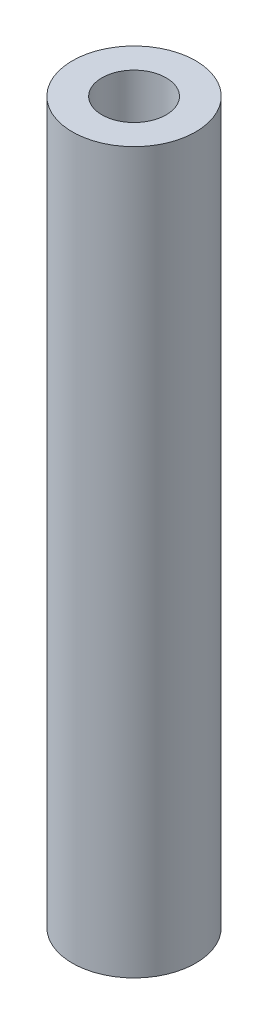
ISO-10303-21;
HEADER;
FILE_DESCRIPTION(('STEP AP214'),'2;1');
FILE_NAME('part.step','',(''),(''),'','','');
FILE_SCHEMA(('AUTOMOTIVE_DESIGN { 1 0 10303 214 1 1 1 1 }'));
ENDSEC;
DATA;
#1=APPLICATION_CONTEXT('core data for automotive mechanical design processes');
#2=APPLICATION_PROTOCOL_DEFINITION('international standard','automotive_design',2000,#1);
#3=PRODUCT_CONTEXT('',#1,'mechanical');
#4=PRODUCT('Part','Part','',(#3));
#5=PRODUCT_RELATED_PRODUCT_CATEGORY('part','',(#4));
#6=PRODUCT_DEFINITION_FORMATION('','',#4);
#7=PRODUCT_DEFINITION_CONTEXT('part definition',#1,'design');
#8=PRODUCT_DEFINITION('design','',#6,#7);
#9=PRODUCT_DEFINITION_SHAPE('','',#8);
#10=(LENGTH_UNIT() NAMED_UNIT(*) SI_UNIT(.MILLI.,.METRE.));
#11=(NAMED_UNIT(*) PLANE_ANGLE_UNIT() SI_UNIT($,.RADIAN.));
#12=(NAMED_UNIT(*) SI_UNIT($,.STERADIAN.) SOLID_ANGLE_UNIT());
#13=UNCERTAINTY_MEASURE_WITH_UNIT(LENGTH_MEASURE(1.E-05),#10,'distance_accuracy_value','');
#14=(GEOMETRIC_REPRESENTATION_CONTEXT(3) GLOBAL_UNCERTAINTY_ASSIGNED_CONTEXT((#13)) GLOBAL_UNIT_ASSIGNED_CONTEXT((#10,
#11,#12)) REPRESENTATION_CONTEXT('',''));
#15=CARTESIAN_POINT('',(0.,0.,0.));
#16=DIRECTION('',(0.,0.,1.));
#17=DIRECTION('',(1.,0.,0.));
#18=AXIS2_PLACEMENT_3D('',#15,#16,#17);
#19=CARTESIAN_POINT('',(0.,55.59,0.));
#20=DIRECTION('',(0.,1.,0.));
#21=DIRECTION('',(0.,0.,1.));
#22=AXIS2_PLACEMENT_3D('',#19,#20,#21);
#23=PLANE('',#22);
#24=CARTESIAN_POINT('',(0.,55.59,0.));
#25=DIRECTION('',(0.,1.,0.));
#26=DIRECTION('',(0.,0.,1.));
#27=AXIS2_PLACEMENT_3D('',#24,#25,#26);
#28=CIRCLE('',#27,4.7625);
#29=CARTESIAN_POINT('',(0.,55.59,-4.7625));
#30=VERTEX_POINT('',#29);
#31=EDGE_CURVE('E10',#30,#30,#28,.T.);
#32=ORIENTED_EDGE('',*,*,#31,.T.);
#33=EDGE_LOOP('',(#32));
#34=FACE_BOUND('',#33,.T.);
#35=CARTESIAN_POINT('',(0.,55.59,0.));
#36=DIRECTION('',(0.,1.,0.));
#37=DIRECTION('',(0.,0.,1.));
#38=AXIS2_PLACEMENT_3D('',#35,#36,#37);
#39=CIRCLE('',#38,2.48125);
#40=CARTESIAN_POINT('',(0.,55.59,-2.48125));
#41=VERTEX_POINT('',#40);
#42=EDGE_CURVE('E54',#41,#41,#39,.T.);
#43=ORIENTED_EDGE('',*,*,#42,.F.);
#44=EDGE_LOOP('',(#43));
#45=FACE_BOUND('',#44,.T.);
#46=ADVANCED_FACE('F41',(#34,#45),#23,.T.);
#47=CARTESIAN_POINT('',(0.,0.,0.));
#48=DIRECTION('',(0.,1.,0.));
#49=DIRECTION('',(0.,0.,1.));
#50=AXIS2_PLACEMENT_3D('',#47,#48,#49);
#51=PLANE('',#50);
#52=CARTESIAN_POINT('',(0.,0.,0.));
#53=DIRECTION('',(0.,1.,0.));
#54=DIRECTION('',(0.,0.,1.));
#55=AXIS2_PLACEMENT_3D('',#52,#53,#54);
#56=CIRCLE('',#55,4.7625);
#57=CARTESIAN_POINT('',(0.,0.,-4.7625));
#58=VERTEX_POINT('',#57);
#59=EDGE_CURVE('E45',#58,#58,#56,.T.);
#60=ORIENTED_EDGE('',*,*,#59,.F.);
#61=EDGE_LOOP('',(#60));
#62=FACE_BOUND('',#61,.T.);
#63=CARTESIAN_POINT('',(0.,0.,0.));
#64=DIRECTION('',(0.,1.,0.));
#65=DIRECTION('',(0.,0.,1.));
#66=AXIS2_PLACEMENT_3D('',#63,#64,#65);
#67=CIRCLE('',#66,2.48125);
#68=CARTESIAN_POINT('',(0.,0.,-2.48125));
#69=VERTEX_POINT('',#68);
#70=EDGE_CURVE('E56',#69,#69,#67,.T.);
#71=ORIENTED_EDGE('',*,*,#70,.T.);
#72=EDGE_LOOP('',(#71));
#73=FACE_BOUND('',#72,.T.);
#74=ADVANCED_FACE('F68',(#62,#73),#51,.F.);
#75=CARTESIAN_POINT('',(0.,55.59,0.));
#76=DIRECTION('',(0.,-1.,0.));
#77=DIRECTION('',(0.,0.,-1.));
#78=AXIS2_PLACEMENT_3D('',#75,#76,#77);
#79=CYLINDRICAL_SURFACE('',#78,4.7625);
#80=CARTESIAN_POINT('',(0.,55.59,-4.7625));
#81=CARTESIAN_POINT('',(0.,55.0109375,-4.7625));
#82=CARTESIAN_POINT('',(0.,54.431875,-4.7625));
#83=CARTESIAN_POINT('',(0.,53.27375,-4.7625));
#84=CARTESIAN_POINT('',(0.,52.6946875,-4.7625));
#85=CARTESIAN_POINT('',(0.,51.5365625,-4.7625));
#86=CARTESIAN_POINT('',(0.,50.9575,-4.7625));
#87=CARTESIAN_POINT('',(0.,49.799375,-4.7625));
#88=CARTESIAN_POINT('',(0.,49.2203125,-4.7625));
#89=CARTESIAN_POINT('',(0.,48.0621875,-4.7625));
#90=CARTESIAN_POINT('',(0.,47.483125,-4.7625));
#91=CARTESIAN_POINT('',(0.,46.325,-4.7625));
#92=CARTESIAN_POINT('',(0.,45.7459375,-4.7625));
#93=CARTESIAN_POINT('',(0.,44.5878125,-4.7625));
#94=CARTESIAN_POINT('',(0.,44.00875,-4.7625));
#95=CARTESIAN_POINT('',(0.,42.850625,-4.7625));
#96=CARTESIAN_POINT('',(0.,42.2715625,-4.7625));
#97=CARTESIAN_POINT('',(0.,41.1134375,-4.7625));
#98=CARTESIAN_POINT('',(0.,40.534375,-4.7625));
#99=CARTESIAN_POINT('',(0.,39.37625,-4.7625));
#100=CARTESIAN_POINT('',(0.,38.7971875,-4.7625));
#101=CARTESIAN_POINT('',(0.,37.6390625,-4.7625));
#102=CARTESIAN_POINT('',(0.,37.06,-4.7625));
#103=CARTESIAN_POINT('',(0.,35.901875,-4.7625));
#104=CARTESIAN_POINT('',(0.,35.3228125,-4.7625));
#105=CARTESIAN_POINT('',(0.,34.1646875,-4.7625));
#106=CARTESIAN_POINT('',(0.,33.585625,-4.7625));
#107=CARTESIAN_POINT('',(0.,32.4275,-4.7625));
#108=CARTESIAN_POINT('',(0.,31.8484375,-4.7625));
#109=CARTESIAN_POINT('',(0.,30.6903125,-4.7625));
#110=CARTESIAN_POINT('',(0.,30.11125,-4.7625));
#111=CARTESIAN_POINT('',(0.,28.953125,-4.7625));
#112=CARTESIAN_POINT('',(0.,28.3740625,-4.7625));
#113=CARTESIAN_POINT('',(0.,27.2159375,-4.7625));
#114=CARTESIAN_POINT('',(0.,26.636875,-4.7625));
#115=CARTESIAN_POINT('',(0.,25.47875,-4.7625));
#116=CARTESIAN_POINT('',(0.,24.8996875,-4.7625));
#117=CARTESIAN_POINT('',(0.,23.7415625,-4.7625));
#118=CARTESIAN_POINT('',(0.,23.1625,-4.7625));
#119=CARTESIAN_POINT('',(0.,22.004375,-4.7625));
#120=CARTESIAN_POINT('',(0.,21.4253125,-4.7625));
#121=CARTESIAN_POINT('',(0.,20.2671875,-4.7625));
#122=CARTESIAN_POINT('',(0.,19.688125,-4.7625));
#123=CARTESIAN_POINT('',(0.,18.53,-4.7625));
#124=CARTESIAN_POINT('',(0.,17.9509375,-4.7625));
#125=CARTESIAN_POINT('',(0.,16.7928125,-4.7625));
#126=CARTESIAN_POINT('',(0.,16.21375,-4.7625));
#127=CARTESIAN_POINT('',(0.,15.055625,-4.7625));
#128=CARTESIAN_POINT('',(0.,14.4765625,-4.7625));
#129=CARTESIAN_POINT('',(0.,13.3184375,-4.7625));
#130=CARTESIAN_POINT('',(0.,12.739375,-4.7625));
#131=CARTESIAN_POINT('',(0.,11.58125,-4.7625));
#132=CARTESIAN_POINT('',(0.,11.0021875,-4.7625));
#133=CARTESIAN_POINT('',(0.,9.8440625,-4.7625));
#134=CARTESIAN_POINT('',(0.,9.265,-4.7625));
#135=CARTESIAN_POINT('',(0.,8.106875,-4.7625));
#136=CARTESIAN_POINT('',(0.,7.5278125,-4.7625));
#137=CARTESIAN_POINT('',(0.,6.3696875,-4.7625));
#138=CARTESIAN_POINT('',(0.,5.790625,-4.7625));
#139=CARTESIAN_POINT('',(0.,4.63249999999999,-4.7625));
#140=CARTESIAN_POINT('',(0.,4.0534375,-4.7625));
#141=CARTESIAN_POINT('',(0.,2.89531249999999,-4.7625));
#142=CARTESIAN_POINT('',(0.,2.31624999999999,-4.7625));
#143=CARTESIAN_POINT('',(0.,1.15812499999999,-4.7625));
#144=CARTESIAN_POINT('',(0.,0.579062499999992,-4.7625));
#145=CARTESIAN_POINT('',(0.,0.,-4.7625));
#146=B_SPLINE_CURVE_WITH_KNOTS('',3,(#80,#81,#82,#83,#84,#85,#86,#87,#88,#89,#90,#91,#92,#93,
#94,#95,#96,#97,#98,#99,#100,#101,#102,#103,#104,#105,#106,#107,#108,#109,#110,#111,#112,#113,
#114,#115,#116,#117,#118,#119,#120,#121,#122,#123,#124,#125,#126,#127,#128,#129,#130,#131,#132,
#133,#134,#135,#136,#137,#138,#139,#140,#141,#142,#143,#144,#145),.UNSPECIFIED.,.F.,.F.,(4,2,2,
2,2,2,2,2,2,2,2,2,2,2,2,2,2,2,2,2,2,2,2,2,2,2,2,2,2,2,2,2,4),(0.,1.7371875,3.474375,5.2115625,
6.94875,8.6859375,10.423125,12.1603125,13.8975,15.6346875,17.371875,19.1090625,20.84625,
22.5834375,24.320625,26.0578125,27.795,29.5321875,31.269375,33.0065625,34.74375,36.4809375,
38.218125,39.9553125,41.6925,43.4296875,45.166875,46.9040625,48.64125,50.3784375,52.115625,
53.8528125,55.59),.UNSPECIFIED.);
#147=EDGE_CURVE('BSEAM43',#30,#58,#146,.T.);
#148=ORIENTED_EDGE('',*,*,#31,.F.);
#149=ORIENTED_EDGE('',*,*,#59,.T.);
#150=ORIENTED_EDGE('',*,*,#147,.T.);
#151=ORIENTED_EDGE('',*,*,#147,.F.);
#152=EDGE_LOOP('',(#148,#150,#149,#151));
#153=FACE_BOUND('',#152,.T.);
#154=ADVANCED_FACE('F43',(#153),#79,.T.);
#155=CARTESIAN_POINT('',(0.,55.59,0.));
#156=DIRECTION('',(0.,-1.,0.));
#157=DIRECTION('',(0.,0.,-1.));
#158=AXIS2_PLACEMENT_3D('',#155,#156,#157);
#159=CYLINDRICAL_SURFACE('',#158,2.48125);
#160=CARTESIAN_POINT('',(0.,55.59,-2.48125));
#161=CARTESIAN_POINT('',(0.,55.0109375,-2.48125));
#162=CARTESIAN_POINT('',(0.,54.431875,-2.48125));
#163=CARTESIAN_POINT('',(0.,53.27375,-2.48125));
#164=CARTESIAN_POINT('',(0.,52.6946875,-2.48125));
#165=CARTESIAN_POINT('',(0.,51.5365625,-2.48125));
#166=CARTESIAN_POINT('',(0.,50.9575,-2.48125));
#167=CARTESIAN_POINT('',(0.,49.799375,-2.48125));
#168=CARTESIAN_POINT('',(0.,49.2203125,-2.48125));
#169=CARTESIAN_POINT('',(0.,48.0621875,-2.48125));
#170=CARTESIAN_POINT('',(0.,47.483125,-2.48125));
#171=CARTESIAN_POINT('',(0.,46.325,-2.48125));
#172=CARTESIAN_POINT('',(0.,45.7459375,-2.48125));
#173=CARTESIAN_POINT('',(0.,44.5878125,-2.48125));
#174=CARTESIAN_POINT('',(0.,44.00875,-2.48125));
#175=CARTESIAN_POINT('',(0.,42.850625,-2.48125));
#176=CARTESIAN_POINT('',(0.,42.2715625,-2.48125));
#177=CARTESIAN_POINT('',(0.,41.1134375,-2.48125));
#178=CARTESIAN_POINT('',(0.,40.534375,-2.48125));
#179=CARTESIAN_POINT('',(0.,39.37625,-2.48125));
#180=CARTESIAN_POINT('',(0.,38.7971875,-2.48125));
#181=CARTESIAN_POINT('',(0.,37.6390625,-2.48125));
#182=CARTESIAN_POINT('',(0.,37.06,-2.48125));
#183=CARTESIAN_POINT('',(0.,35.901875,-2.48125));
#184=CARTESIAN_POINT('',(0.,35.3228125,-2.48125));
#185=CARTESIAN_POINT('',(0.,34.1646875,-2.48125));
#186=CARTESIAN_POINT('',(0.,33.585625,-2.48125));
#187=CARTESIAN_POINT('',(0.,32.4275,-2.48125));
#188=CARTESIAN_POINT('',(0.,31.8484375,-2.48125));
#189=CARTESIAN_POINT('',(0.,30.6903125,-2.48125));
#190=CARTESIAN_POINT('',(0.,30.11125,-2.48125));
#191=CARTESIAN_POINT('',(0.,28.953125,-2.48125));
#192=CARTESIAN_POINT('',(0.,28.3740625,-2.48125));
#193=CARTESIAN_POINT('',(0.,27.2159375,-2.48125));
#194=CARTESIAN_POINT('',(0.,26.636875,-2.48125));
#195=CARTESIAN_POINT('',(0.,25.47875,-2.48125));
#196=CARTESIAN_POINT('',(0.,24.8996875,-2.48125));
#197=CARTESIAN_POINT('',(0.,23.7415625,-2.48125));
#198=CARTESIAN_POINT('',(0.,23.1625,-2.48125));
#199=CARTESIAN_POINT('',(0.,22.004375,-2.48125));
#200=CARTESIAN_POINT('',(0.,21.4253125,-2.48125));
#201=CARTESIAN_POINT('',(0.,20.2671875,-2.48125));
#202=CARTESIAN_POINT('',(0.,19.688125,-2.48125));
#203=CARTESIAN_POINT('',(0.,18.53,-2.48125));
#204=CARTESIAN_POINT('',(0.,17.9509375,-2.48125));
#205=CARTESIAN_POINT('',(0.,16.7928125,-2.48125));
#206=CARTESIAN_POINT('',(0.,16.21375,-2.48125));
#207=CARTESIAN_POINT('',(0.,15.055625,-2.48125));
#208=CARTESIAN_POINT('',(0.,14.4765625,-2.48125));
#209=CARTESIAN_POINT('',(0.,13.3184375,-2.48125));
#210=CARTESIAN_POINT('',(0.,12.739375,-2.48125));
#211=CARTESIAN_POINT('',(0.,11.58125,-2.48125));
#212=CARTESIAN_POINT('',(0.,11.0021875,-2.48125));
#213=CARTESIAN_POINT('',(0.,9.84406249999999,-2.48125));
#214=CARTESIAN_POINT('',(0.,9.265,-2.48125));
#215=CARTESIAN_POINT('',(0.,8.106875,-2.48125));
#216=CARTESIAN_POINT('',(0.,7.5278125,-2.48125));
#217=CARTESIAN_POINT('',(0.,6.3696875,-2.48125));
#218=CARTESIAN_POINT('',(0.,5.790625,-2.48125));
#219=CARTESIAN_POINT('',(0.,4.63249999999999,-2.48125));
#220=CARTESIAN_POINT('',(0.,4.0534375,-2.48125));
#221=CARTESIAN_POINT('',(0.,2.89531249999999,-2.48125));
#222=CARTESIAN_POINT('',(0.,2.31624999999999,-2.48125));
#223=CARTESIAN_POINT('',(0.,1.15812499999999,-2.48125));
#224=CARTESIAN_POINT('',(0.,0.579062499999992,-2.48125));
#225=CARTESIAN_POINT('',(0.,0.,-2.48125));
#226=B_SPLINE_CURVE_WITH_KNOTS('',3,(#160,#161,#162,#163,#164,#165,#166,#167,#168,#169,#170,
#171,#172,#173,#174,#175,#176,#177,#178,#179,#180,#181,#182,#183,#184,#185,#186,#187,#188,#189,
#190,#191,#192,#193,#194,#195,#196,#197,#198,#199,#200,#201,#202,#203,#204,#205,#206,#207,#208,
#209,#210,#211,#212,#213,#214,#215,#216,#217,#218,#219,#220,#221,#222,#223,#224,#225),
.UNSPECIFIED.,.F.,.F.,(4,2,2,2,2,2,2,2,2,2,2,2,2,2,2,2,2,2,2,2,2,2,2,2,2,2,2,2,2,2,2,2,4),(0.,
1.73718749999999,3.47437499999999,5.2115625,6.94875,8.6859375,10.423125,12.1603125,13.8975,
15.6346875,17.371875,19.1090625,20.84625,22.5834375,24.320625,26.0578125,27.795,29.5321875,
31.269375,33.0065625,34.74375,36.4809375,38.218125,39.9553125,41.6925,43.4296875,45.166875,
46.9040625,48.64125,50.3784375,52.115625,53.8528125,55.59),.UNSPECIFIED.);
#227=EDGE_CURVE('BSEAM64',#41,#69,#226,.T.);
#228=ORIENTED_EDGE('',*,*,#42,.T.);
#229=ORIENTED_EDGE('',*,*,#70,.F.);
#230=ORIENTED_EDGE('',*,*,#227,.T.);
#231=ORIENTED_EDGE('',*,*,#227,.F.);
#232=EDGE_LOOP('',(#228,#230,#229,#231));
#233=FACE_BOUND('',#232,.T.);
#234=ADVANCED_FACE('F64',(#233),#159,.F.);
#235=CLOSED_SHELL('',(#46,#74,#154,#234));
#236=MANIFOLD_SOLID_BREP('B2',#235);
#237=ADVANCED_BREP_SHAPE_REPRESENTATION('',(#18,#236),#14);
#238=SHAPE_DEFINITION_REPRESENTATION(#9,#237);
ENDSEC;
END-ISO-10303-21;
